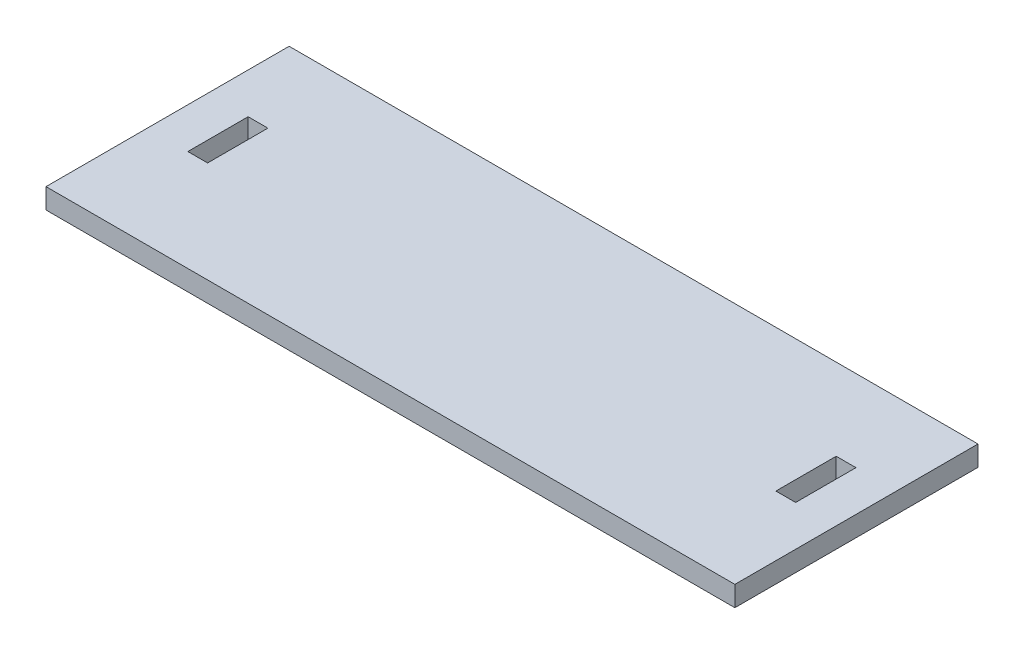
ISO-10303-21;
HEADER;
FILE_DESCRIPTION(('STEP AP214'),'2;1');
FILE_NAME('part.step','',(''),(''),'','','');
FILE_SCHEMA(('AUTOMOTIVE_DESIGN { 1 0 10303 214 1 1 1 1 }'));
ENDSEC;
DATA;
#1=APPLICATION_CONTEXT('core data for automotive mechanical design processes');
#2=APPLICATION_PROTOCOL_DEFINITION('international standard','automotive_design',2000,#1);
#3=PRODUCT_CONTEXT('',#1,'mechanical');
#4=PRODUCT('Part','Part','',(#3));
#5=PRODUCT_RELATED_PRODUCT_CATEGORY('part','',(#4));
#6=PRODUCT_DEFINITION_FORMATION('','',#4);
#7=PRODUCT_DEFINITION_CONTEXT('part definition',#1,'design');
#8=PRODUCT_DEFINITION('design','',#6,#7);
#9=PRODUCT_DEFINITION_SHAPE('','',#8);
#10=(LENGTH_UNIT() NAMED_UNIT(*) SI_UNIT(.MILLI.,.METRE.));
#11=(NAMED_UNIT(*) PLANE_ANGLE_UNIT() SI_UNIT($,.RADIAN.));
#12=(NAMED_UNIT(*) SI_UNIT($,.STERADIAN.) SOLID_ANGLE_UNIT());
#13=UNCERTAINTY_MEASURE_WITH_UNIT(LENGTH_MEASURE(1.E-05),#10,'distance_accuracy_value','');
#14=(GEOMETRIC_REPRESENTATION_CONTEXT(3) GLOBAL_UNCERTAINTY_ASSIGNED_CONTEXT((#13)) GLOBAL_UNIT_ASSIGNED_CONTEXT((#10,
#11,#12)) REPRESENTATION_CONTEXT('',''));
#15=CARTESIAN_POINT('',(0.,0.,0.));
#16=DIRECTION('',(0.,0.,1.));
#17=DIRECTION('',(1.,0.,0.));
#18=AXIS2_PLACEMENT_3D('',#15,#16,#17);
#19=CARTESIAN_POINT('',(0.,10.,0.));
#20=DIRECTION('',(0.,1.,0.));
#21=DIRECTION('',(0.,0.,1.));
#22=AXIS2_PLACEMENT_3D('',#19,#20,#21);
#23=PLANE('',#22);
#24=DIRECTION('',(0.,0.,1.));
#25=VECTOR('',#24,1.);
#26=CARTESIAN_POINT('',(-68.7616014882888,10.,-8.21753100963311));
#27=LINE('',#26,#25);
#28=CARTESIAN_POINT('',(-68.7616014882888,10.,-8.21753100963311));
#29=VERTEX_POINT('',#28);
#30=CARTESIAN_POINT('',(-68.7616014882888,10.,111.782468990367));
#31=VERTEX_POINT('',#30);
#32=EDGE_CURVE('E214',#29,#31,#27,.T.);
#33=ORIENTED_EDGE('',*,*,#32,.T.);
#34=DIRECTION('',(1.,0.,0.));
#35=VECTOR('',#34,1.);
#36=CARTESIAN_POINT('',(-68.7616014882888,10.,111.782468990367));
#37=LINE('',#36,#35);
#38=CARTESIAN_POINT('',(271.238398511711,10.,111.782468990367));
#39=VERTEX_POINT('',#38);
#40=EDGE_CURVE('E219',#31,#39,#37,.T.);
#41=ORIENTED_EDGE('',*,*,#40,.T.);
#42=DIRECTION('',(0.,0.,-1.));
#43=VECTOR('',#42,1.);
#44=CARTESIAN_POINT('',(271.238398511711,10.,-8.21753100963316));
#45=LINE('',#44,#43);
#46=CARTESIAN_POINT('',(271.238398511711,10.,-8.21753100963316));
#47=VERTEX_POINT('',#46);
#48=EDGE_CURVE('E227',#39,#47,#45,.T.);
#49=ORIENTED_EDGE('',*,*,#48,.T.);
#50=DIRECTION('',(-1.,0.,0.));
#51=VECTOR('',#50,1.);
#52=CARTESIAN_POINT('',(-68.7616014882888,10.,-8.21753100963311));
#53=LINE('',#52,#51);
#54=EDGE_CURVE('E230',#47,#29,#53,.T.);
#55=ORIENTED_EDGE('',*,*,#54,.T.);
#56=EDGE_LOOP('',(#33,#41,#49,#55));
#57=FACE_BOUND('',#56,.T.);
#58=DIRECTION('',(1.,0.,0.));
#59=VECTOR('',#58,1.);
#60=CARTESIAN_POINT('',(-48.7616014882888,10.,61.7824689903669));
#61=LINE('',#60,#59);
#62=CARTESIAN_POINT('',(-48.7616014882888,10.,61.7824689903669));
#63=VERTEX_POINT('',#62);
#64=CARTESIAN_POINT('',(-39.0016014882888,10.,61.7824689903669));
#65=VERTEX_POINT('',#64);
#66=EDGE_CURVE('E180',#63,#65,#61,.T.);
#67=ORIENTED_EDGE('',*,*,#66,.F.);
#68=DIRECTION('',(0.,0.,1.));
#69=VECTOR('',#68,1.);
#70=CARTESIAN_POINT('',(-48.7616014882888,10.,32.0224689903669));
#71=LINE('',#70,#69);
#72=CARTESIAN_POINT('',(-48.7616014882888,10.,32.0224689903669));
#73=VERTEX_POINT('',#72);
#74=EDGE_CURVE('E176',#73,#63,#71,.T.);
#75=ORIENTED_EDGE('',*,*,#74,.F.);
#76=DIRECTION('',(-1.,0.,0.));
#77=VECTOR('',#76,1.);
#78=CARTESIAN_POINT('',(-48.7616014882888,10.,32.0224689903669));
#79=LINE('',#78,#77);
#80=CARTESIAN_POINT('',(-39.0016014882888,10.,32.0224689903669));
#81=VERTEX_POINT('',#80);
#82=EDGE_CURVE('E187',#81,#73,#79,.T.);
#83=ORIENTED_EDGE('',*,*,#82,.F.);
#84=DIRECTION('',(0.,0.,-1.));
#85=VECTOR('',#84,1.);
#86=CARTESIAN_POINT('',(-39.0016014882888,10.,32.0224689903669));
#87=LINE('',#86,#85);
#88=EDGE_CURVE('E192',#65,#81,#87,.T.);
#89=ORIENTED_EDGE('',*,*,#88,.F.);
#90=EDGE_LOOP('',(#67,#75,#83,#89));
#91=FACE_BOUND('',#90,.T.);
#92=DIRECTION('',(-1.,0.,0.));
#93=VECTOR('',#92,1.);
#94=CARTESIAN_POINT('',(251.238398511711,10.,32.0224689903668));
#95=LINE('',#94,#93);
#96=CARTESIAN_POINT('',(251.238398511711,10.,32.0224689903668));
#97=VERTEX_POINT('',#96);
#98=CARTESIAN_POINT('',(241.478398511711,10.,32.0224689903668));
#99=VERTEX_POINT('',#98);
#100=EDGE_CURVE('E136',#97,#99,#95,.T.);
#101=ORIENTED_EDGE('',*,*,#100,.F.);
#102=DIRECTION('',(0.,0.,-1.));
#103=VECTOR('',#102,1.);
#104=CARTESIAN_POINT('',(251.238398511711,10.,32.0224689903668));
#105=LINE('',#104,#103);
#106=CARTESIAN_POINT('',(251.238398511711,10.,61.7824689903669));
#107=VERTEX_POINT('',#106);
#108=EDGE_CURVE('E127',#107,#97,#105,.T.);
#109=ORIENTED_EDGE('',*,*,#108,.F.);
#110=DIRECTION('',(1.,0.,0.));
#111=VECTOR('',#110,1.);
#112=CARTESIAN_POINT('',(251.238398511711,10.,61.7824689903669));
#113=LINE('',#112,#111);
#114=CARTESIAN_POINT('',(241.478398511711,10.,61.7824689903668));
#115=VERTEX_POINT('',#114);
#116=EDGE_CURVE('E153',#115,#107,#113,.T.);
#117=ORIENTED_EDGE('',*,*,#116,.F.);
#118=DIRECTION('',(0.,0.,1.));
#119=VECTOR('',#118,1.);
#120=CARTESIAN_POINT('',(241.478398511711,10.,32.0224689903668));
#121=LINE('',#120,#119);
#122=EDGE_CURVE('E148',#99,#115,#121,.T.);
#123=ORIENTED_EDGE('',*,*,#122,.F.);
#124=EDGE_LOOP('',(#101,#109,#117,#123));
#125=FACE_BOUND('',#124,.T.);
#126=ADVANCED_FACE('F38',(#57,#91,#125),#23,.T.);
#127=CARTESIAN_POINT('',(0.,0.,0.));
#128=DIRECTION('',(0.,1.,0.));
#129=DIRECTION('',(0.,0.,1.));
#130=AXIS2_PLACEMENT_3D('',#127,#128,#129);
#131=PLANE('',#130);
#132=DIRECTION('',(0.,0.,1.));
#133=VECTOR('',#132,1.);
#134=CARTESIAN_POINT('',(-48.7616014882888,0.,32.0224689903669));
#135=LINE('',#134,#133);
#136=CARTESIAN_POINT('',(-48.7616014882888,0.,32.0224689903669));
#137=VERTEX_POINT('',#136);
#138=CARTESIAN_POINT('',(-48.7616014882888,0.,61.7824689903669));
#139=VERTEX_POINT('',#138);
#140=EDGE_CURVE('E144',#137,#139,#135,.T.);
#141=ORIENTED_EDGE('',*,*,#140,.T.);
#142=DIRECTION('',(1.,0.,0.));
#143=VECTOR('',#142,1.);
#144=CARTESIAN_POINT('',(-48.7616014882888,0.,61.7824689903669));
#145=LINE('',#144,#143);
#146=CARTESIAN_POINT('',(-39.0016014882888,0.,61.7824689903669));
#147=VERTEX_POINT('',#146);
#148=EDGE_CURVE('E196',#139,#147,#145,.T.);
#149=ORIENTED_EDGE('',*,*,#148,.T.);
#150=DIRECTION('',(0.,0.,-1.));
#151=VECTOR('',#150,1.);
#152=CARTESIAN_POINT('',(-39.0016014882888,0.,32.0224689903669));
#153=LINE('',#152,#151);
#154=CARTESIAN_POINT('',(-39.0016014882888,0.,32.0224689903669));
#155=VERTEX_POINT('',#154);
#156=EDGE_CURVE('E199',#147,#155,#153,.T.);
#157=ORIENTED_EDGE('',*,*,#156,.T.);
#158=DIRECTION('',(-1.,0.,0.));
#159=VECTOR('',#158,1.);
#160=CARTESIAN_POINT('',(-48.7616014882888,0.,32.0224689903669));
#161=LINE('',#160,#159);
#162=EDGE_CURVE('E181',#155,#137,#161,.T.);
#163=ORIENTED_EDGE('',*,*,#162,.T.);
#164=EDGE_LOOP('',(#141,#149,#157,#163));
#165=FACE_BOUND('',#164,.T.);
#166=DIRECTION('',(0.,0.,1.));
#167=VECTOR('',#166,1.);
#168=CARTESIAN_POINT('',(-68.7616014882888,0.,-8.21753100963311));
#169=LINE('',#168,#167);
#170=CARTESIAN_POINT('',(-68.7616014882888,0.,-8.21753100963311));
#171=VERTEX_POINT('',#170);
#172=CARTESIAN_POINT('',(-68.7616014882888,0.,111.782468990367));
#173=VERTEX_POINT('',#172);
#174=EDGE_CURVE('E213',#171,#173,#169,.T.);
#175=ORIENTED_EDGE('',*,*,#174,.F.);
#176=DIRECTION('',(-1.,0.,0.));
#177=VECTOR('',#176,1.);
#178=CARTESIAN_POINT('',(-68.7616014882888,0.,-8.21753100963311));
#179=LINE('',#178,#177);
#180=CARTESIAN_POINT('',(271.238398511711,0.,-8.21753100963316));
#181=VERTEX_POINT('',#180);
#182=EDGE_CURVE('E220',#181,#171,#179,.T.);
#183=ORIENTED_EDGE('',*,*,#182,.F.);
#184=DIRECTION('',(0.,0.,-1.));
#185=VECTOR('',#184,1.);
#186=CARTESIAN_POINT('',(271.238398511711,0.,-8.21753100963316));
#187=LINE('',#186,#185);
#188=CARTESIAN_POINT('',(271.238398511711,0.,111.782468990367));
#189=VERTEX_POINT('',#188);
#190=EDGE_CURVE('E239',#189,#181,#187,.T.);
#191=ORIENTED_EDGE('',*,*,#190,.F.);
#192=DIRECTION('',(1.,0.,0.));
#193=VECTOR('',#192,1.);
#194=CARTESIAN_POINT('',(-68.7616014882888,0.,111.782468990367));
#195=LINE('',#194,#193);
#196=EDGE_CURVE('E237',#173,#189,#195,.T.);
#197=ORIENTED_EDGE('',*,*,#196,.F.);
#198=EDGE_LOOP('',(#175,#183,#191,#197));
#199=FACE_BOUND('',#198,.T.);
#200=DIRECTION('',(0.,0.,-1.));
#201=VECTOR('',#200,1.);
#202=CARTESIAN_POINT('',(251.238398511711,0.,32.0224689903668));
#203=LINE('',#202,#201);
#204=CARTESIAN_POINT('',(251.238398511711,0.,61.7824689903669));
#205=VERTEX_POINT('',#204);
#206=CARTESIAN_POINT('',(251.238398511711,0.,32.0224689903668));
#207=VERTEX_POINT('',#206);
#208=EDGE_CURVE('E61',#205,#207,#203,.T.);
#209=ORIENTED_EDGE('',*,*,#208,.T.);
#210=DIRECTION('',(-1.,0.,0.));
#211=VECTOR('',#210,1.);
#212=CARTESIAN_POINT('',(251.238398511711,0.,32.0224689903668));
#213=LINE('',#212,#211);
#214=CARTESIAN_POINT('',(241.478398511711,0.,32.0224689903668));
#215=VERTEX_POINT('',#214);
#216=EDGE_CURVE('E143',#207,#215,#213,.T.);
#217=ORIENTED_EDGE('',*,*,#216,.T.);
#218=DIRECTION('',(0.,0.,1.));
#219=VECTOR('',#218,1.);
#220=CARTESIAN_POINT('',(241.478398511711,0.,32.0224689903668));
#221=LINE('',#220,#219);
#222=CARTESIAN_POINT('',(241.478398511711,0.,61.7824689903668));
#223=VERTEX_POINT('',#222);
#224=EDGE_CURVE('E168',#215,#223,#221,.T.);
#225=ORIENTED_EDGE('',*,*,#224,.T.);
#226=DIRECTION('',(1.,0.,0.));
#227=VECTOR('',#226,1.);
#228=CARTESIAN_POINT('',(251.238398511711,0.,61.7824689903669));
#229=LINE('',#228,#227);
#230=EDGE_CURVE('E137',#223,#205,#229,.T.);
#231=ORIENTED_EDGE('',*,*,#230,.T.);
#232=EDGE_LOOP('',(#209,#217,#225,#231));
#233=FACE_BOUND('',#232,.T.);
#234=ADVANCED_FACE('F257',(#165,#199,#233),#131,.F.);
#235=CARTESIAN_POINT('',(-68.7616014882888,10.,-8.21753100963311));
#236=DIRECTION('',(1.,0.,0.));
#237=DIRECTION('',(0.,0.,-1.));
#238=AXIS2_PLACEMENT_3D('',#235,#236,#237);
#239=PLANE('',#238);
#240=ORIENTED_EDGE('',*,*,#174,.T.);
#241=DIRECTION('',(0.,-1.,0.));
#242=VECTOR('',#241,1.);
#243=CARTESIAN_POINT('',(-68.7616014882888,10.,111.782468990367));
#244=LINE('',#243,#242);
#245=EDGE_CURVE('E12',#31,#173,#244,.T.);
#246=ORIENTED_EDGE('',*,*,#245,.F.);
#247=ORIENTED_EDGE('',*,*,#32,.F.);
#248=DIRECTION('',(0.,-1.,0.));
#249=VECTOR('',#248,1.);
#250=CARTESIAN_POINT('',(-68.7616014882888,10.,-8.21753100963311));
#251=LINE('',#250,#249);
#252=EDGE_CURVE('E234',#29,#171,#251,.T.);
#253=ORIENTED_EDGE('',*,*,#252,.T.);
#254=EDGE_LOOP('',(#240,#246,#247,#253));
#255=FACE_BOUND('',#254,.T.);
#256=ADVANCED_FACE('F40',(#255),#239,.F.);
#257=CARTESIAN_POINT('',(-68.7616014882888,10.,111.782468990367));
#258=DIRECTION('',(0.,0.,-1.));
#259=DIRECTION('',(-1.,0.,0.));
#260=AXIS2_PLACEMENT_3D('',#257,#258,#259);
#261=PLANE('',#260);
#262=ORIENTED_EDGE('',*,*,#196,.T.);
#263=DIRECTION('',(0.,-1.,0.));
#264=VECTOR('',#263,1.);
#265=CARTESIAN_POINT('',(271.238398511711,10.,111.782468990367));
#266=LINE('',#265,#264);
#267=EDGE_CURVE('E46',#39,#189,#266,.T.);
#268=ORIENTED_EDGE('',*,*,#267,.F.);
#269=ORIENTED_EDGE('',*,*,#40,.F.);
#270=ORIENTED_EDGE('',*,*,#245,.T.);
#271=EDGE_LOOP('',(#262,#268,#269,#270));
#272=FACE_BOUND('',#271,.T.);
#273=ADVANCED_FACE('F307',(#272),#261,.F.);
#274=CARTESIAN_POINT('',(271.238398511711,10.,-8.21753100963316));
#275=DIRECTION('',(-1.,0.,0.));
#276=DIRECTION('',(0.,0.,1.));
#277=AXIS2_PLACEMENT_3D('',#274,#275,#276);
#278=PLANE('',#277);
#279=ORIENTED_EDGE('',*,*,#190,.T.);
#280=DIRECTION('',(0.,-1.,0.));
#281=VECTOR('',#280,1.);
#282=CARTESIAN_POINT('',(271.238398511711,10.,-8.21753100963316));
#283=LINE('',#282,#281);
#284=EDGE_CURVE('E244',#47,#181,#283,.T.);
#285=ORIENTED_EDGE('',*,*,#284,.F.);
#286=ORIENTED_EDGE('',*,*,#48,.F.);
#287=ORIENTED_EDGE('',*,*,#267,.T.);
#288=EDGE_LOOP('',(#279,#285,#286,#287));
#289=FACE_BOUND('',#288,.T.);
#290=ADVANCED_FACE('F251',(#289),#278,.F.);
#291=CARTESIAN_POINT('',(-68.7616014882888,10.,-8.21753100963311));
#292=DIRECTION('',(0.,0.,1.));
#293=DIRECTION('',(1.,0.,0.));
#294=AXIS2_PLACEMENT_3D('',#291,#292,#293);
#295=PLANE('',#294);
#296=ORIENTED_EDGE('',*,*,#182,.T.);
#297=ORIENTED_EDGE('',*,*,#252,.F.);
#298=ORIENTED_EDGE('',*,*,#54,.F.);
#299=ORIENTED_EDGE('',*,*,#284,.T.);
#300=EDGE_LOOP('',(#296,#297,#298,#299));
#301=FACE_BOUND('',#300,.T.);
#302=ADVANCED_FACE('F261',(#301),#295,.F.);
#303=CARTESIAN_POINT('',(-48.7616014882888,10.,32.0224689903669));
#304=DIRECTION('',(1.,0.,0.));
#305=DIRECTION('',(0.,0.,-1.));
#306=AXIS2_PLACEMENT_3D('',#303,#304,#305);
#307=PLANE('',#306);
#308=ORIENTED_EDGE('',*,*,#140,.F.);
#309=DIRECTION('',(0.,-1.,0.));
#310=VECTOR('',#309,1.);
#311=CARTESIAN_POINT('',(-48.7616014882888,10.,32.0224689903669));
#312=LINE('',#311,#310);
#313=EDGE_CURVE('E191',#73,#137,#312,.T.);
#314=ORIENTED_EDGE('',*,*,#313,.F.);
#315=ORIENTED_EDGE('',*,*,#74,.T.);
#316=DIRECTION('',(0.,-1.,0.));
#317=VECTOR('',#316,1.);
#318=CARTESIAN_POINT('',(-48.7616014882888,10.,61.7824689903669));
#319=LINE('',#318,#317);
#320=EDGE_CURVE('E210',#63,#139,#319,.T.);
#321=ORIENTED_EDGE('',*,*,#320,.T.);
#322=EDGE_LOOP('',(#308,#314,#315,#321));
#323=FACE_BOUND('',#322,.T.);
#324=ADVANCED_FACE('F284',(#323),#307,.T.);
#325=CARTESIAN_POINT('',(-48.7616014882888,10.,61.7824689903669));
#326=DIRECTION('',(0.,0.,-1.));
#327=DIRECTION('',(-1.,0.,0.));
#328=AXIS2_PLACEMENT_3D('',#325,#326,#327);
#329=PLANE('',#328);
#330=ORIENTED_EDGE('',*,*,#148,.F.);
#331=ORIENTED_EDGE('',*,*,#320,.F.);
#332=ORIENTED_EDGE('',*,*,#66,.T.);
#333=DIRECTION('',(0.,-1.,0.));
#334=VECTOR('',#333,1.);
#335=CARTESIAN_POINT('',(-39.0016014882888,10.,61.7824689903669));
#336=LINE('',#335,#334);
#337=EDGE_CURVE('E208',#65,#147,#336,.T.);
#338=ORIENTED_EDGE('',*,*,#337,.T.);
#339=EDGE_LOOP('',(#330,#331,#332,#338));
#340=FACE_BOUND('',#339,.T.);
#341=ADVANCED_FACE('F288',(#340),#329,.T.);
#342=CARTESIAN_POINT('',(-39.0016014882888,10.,32.0224689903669));
#343=DIRECTION('',(-1.,0.,0.));
#344=DIRECTION('',(0.,0.,1.));
#345=AXIS2_PLACEMENT_3D('',#342,#343,#344);
#346=PLANE('',#345);
#347=ORIENTED_EDGE('',*,*,#156,.F.);
#348=ORIENTED_EDGE('',*,*,#337,.F.);
#349=ORIENTED_EDGE('',*,*,#88,.T.);
#350=DIRECTION('',(0.,-1.,0.));
#351=VECTOR('',#350,1.);
#352=CARTESIAN_POINT('',(-39.0016014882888,10.,32.0224689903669));
#353=LINE('',#352,#351);
#354=EDGE_CURVE('E206',#81,#155,#353,.T.);
#355=ORIENTED_EDGE('',*,*,#354,.T.);
#356=EDGE_LOOP('',(#347,#348,#349,#355));
#357=FACE_BOUND('',#356,.T.);
#358=ADVANCED_FACE('F276',(#357),#346,.T.);
#359=CARTESIAN_POINT('',(-48.7616014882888,10.,32.0224689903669));
#360=DIRECTION('',(0.,0.,1.));
#361=DIRECTION('',(1.,0.,0.));
#362=AXIS2_PLACEMENT_3D('',#359,#360,#361);
#363=PLANE('',#362);
#364=ORIENTED_EDGE('',*,*,#162,.F.);
#365=ORIENTED_EDGE('',*,*,#354,.F.);
#366=ORIENTED_EDGE('',*,*,#82,.T.);
#367=ORIENTED_EDGE('',*,*,#313,.T.);
#368=EDGE_LOOP('',(#364,#365,#366,#367));
#369=FACE_BOUND('',#368,.T.);
#370=ADVANCED_FACE('F282',(#369),#363,.T.);
#371=CARTESIAN_POINT('',(251.238398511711,10.,32.0224689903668));
#372=DIRECTION('',(-1.,0.,0.));
#373=DIRECTION('',(0.,0.,1.));
#374=AXIS2_PLACEMENT_3D('',#371,#372,#373);
#375=PLANE('',#374);
#376=ORIENTED_EDGE('',*,*,#208,.F.);
#377=DIRECTION('',(0.,-1.,0.));
#378=VECTOR('',#377,1.);
#379=CARTESIAN_POINT('',(251.238398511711,10.,61.7824689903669));
#380=LINE('',#379,#378);
#381=EDGE_CURVE('E131',#107,#205,#380,.T.);
#382=ORIENTED_EDGE('',*,*,#381,.F.);
#383=ORIENTED_EDGE('',*,*,#108,.T.);
#384=DIRECTION('',(0.,-1.,0.));
#385=VECTOR('',#384,1.);
#386=CARTESIAN_POINT('',(251.238398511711,10.,32.0224689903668));
#387=LINE('',#386,#385);
#388=EDGE_CURVE('E130',#97,#207,#387,.T.);
#389=ORIENTED_EDGE('',*,*,#388,.T.);
#390=EDGE_LOOP('',(#376,#382,#383,#389));
#391=FACE_BOUND('',#390,.T.);
#392=ADVANCED_FACE('F129',(#391),#375,.T.);
#393=CARTESIAN_POINT('',(251.238398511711,10.,32.0224689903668));
#394=DIRECTION('',(0.,0.,1.));
#395=DIRECTION('',(1.,0.,0.));
#396=AXIS2_PLACEMENT_3D('',#393,#394,#395);
#397=PLANE('',#396);
#398=ORIENTED_EDGE('',*,*,#216,.F.);
#399=ORIENTED_EDGE('',*,*,#388,.F.);
#400=ORIENTED_EDGE('',*,*,#100,.T.);
#401=DIRECTION('',(0.,-1.,0.));
#402=VECTOR('',#401,1.);
#403=CARTESIAN_POINT('',(241.478398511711,10.,32.0224689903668));
#404=LINE('',#403,#402);
#405=EDGE_CURVE('E145',#99,#215,#404,.T.);
#406=ORIENTED_EDGE('',*,*,#405,.T.);
#407=EDGE_LOOP('',(#398,#399,#400,#406));
#408=FACE_BOUND('',#407,.T.);
#409=ADVANCED_FACE('F140',(#408),#397,.T.);
#410=CARTESIAN_POINT('',(241.478398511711,10.,32.0224689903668));
#411=DIRECTION('',(1.,0.,0.));
#412=DIRECTION('',(0.,0.,-1.));
#413=AXIS2_PLACEMENT_3D('',#410,#411,#412);
#414=PLANE('',#413);
#415=ORIENTED_EDGE('',*,*,#224,.F.);
#416=ORIENTED_EDGE('',*,*,#405,.F.);
#417=ORIENTED_EDGE('',*,*,#122,.T.);
#418=DIRECTION('',(0.,-1.,0.));
#419=VECTOR('',#418,1.);
#420=CARTESIAN_POINT('',(241.478398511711,10.,61.7824689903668));
#421=LINE('',#420,#419);
#422=EDGE_CURVE('E53',#115,#223,#421,.T.);
#423=ORIENTED_EDGE('',*,*,#422,.T.);
#424=EDGE_LOOP('',(#415,#416,#417,#423));
#425=FACE_BOUND('',#424,.T.);
#426=ADVANCED_FACE('F376',(#425),#414,.T.);
#427=CARTESIAN_POINT('',(251.238398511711,10.,61.7824689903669));
#428=DIRECTION('',(0.,0.,-1.));
#429=DIRECTION('',(-1.,0.,0.));
#430=AXIS2_PLACEMENT_3D('',#427,#428,#429);
#431=PLANE('',#430);
#432=ORIENTED_EDGE('',*,*,#230,.F.);
#433=ORIENTED_EDGE('',*,*,#422,.F.);
#434=ORIENTED_EDGE('',*,*,#116,.T.);
#435=ORIENTED_EDGE('',*,*,#381,.T.);
#436=EDGE_LOOP('',(#432,#433,#434,#435));
#437=FACE_BOUND('',#436,.T.);
#438=ADVANCED_FACE('F384',(#437),#431,.T.);
#439=CLOSED_SHELL('',(#126,#234,#256,#273,#290,#302,#324,#341,#358,#370,#392,#409,#426,#438));
#440=MANIFOLD_SOLID_BREP('B2',#439);
#441=ADVANCED_BREP_SHAPE_REPRESENTATION('',(#18,#440),#14);
#442=SHAPE_DEFINITION_REPRESENTATION(#9,#441);
ENDSEC;
END-ISO-10303-21;
